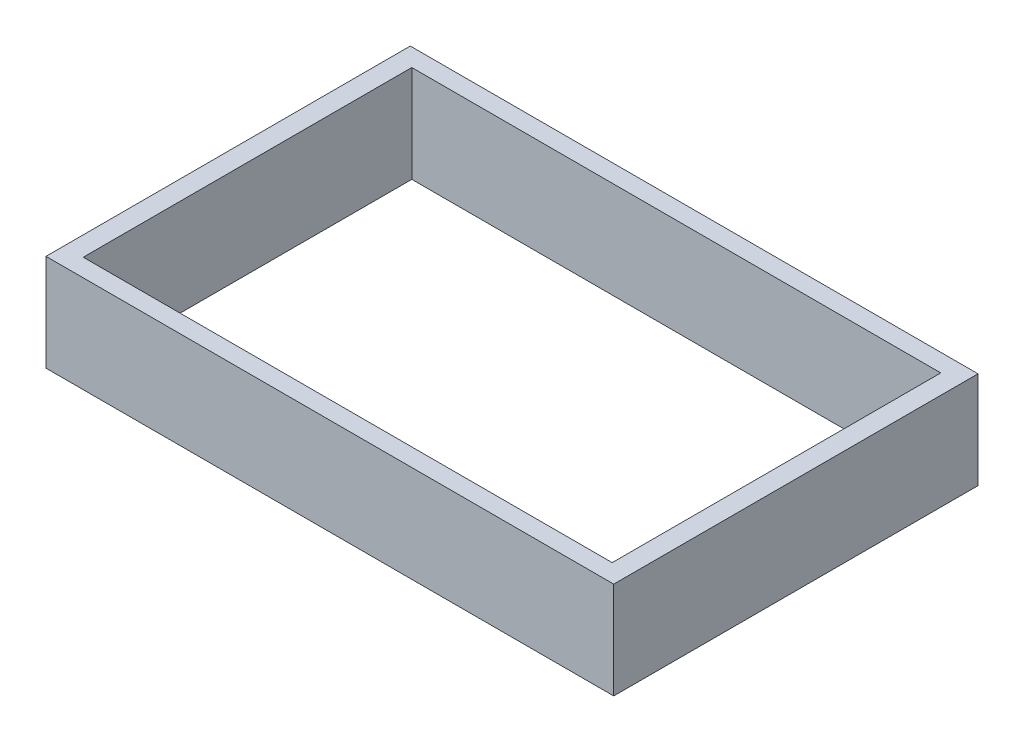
from build123d import *

# Parameters (mm, degrees)
SKETCH1_W           = 586
SKETCH1_H           = 376
SKETCH1_W_2         = 546
SKETCH1_H_2         = 339.15
BOSS_EXTRUDE1_DEPTH = 100


with BuildPart() as part:
    # Sketch1 → Boss-Extrude1 (new body)
    with BuildSketch(Plane(origin=(0, 0, 0), x_dir=(1, 0, 0), z_dir=(0, 1, 0))):
        Rectangle(SKETCH1_W, SKETCH1_H)
        Rectangle(SKETCH1_W_2, SKETCH1_H_2, mode=Mode.SUBTRACT)
    extrude(amount=BOSS_EXTRUDE1_DEPTH)


solid = part.part
